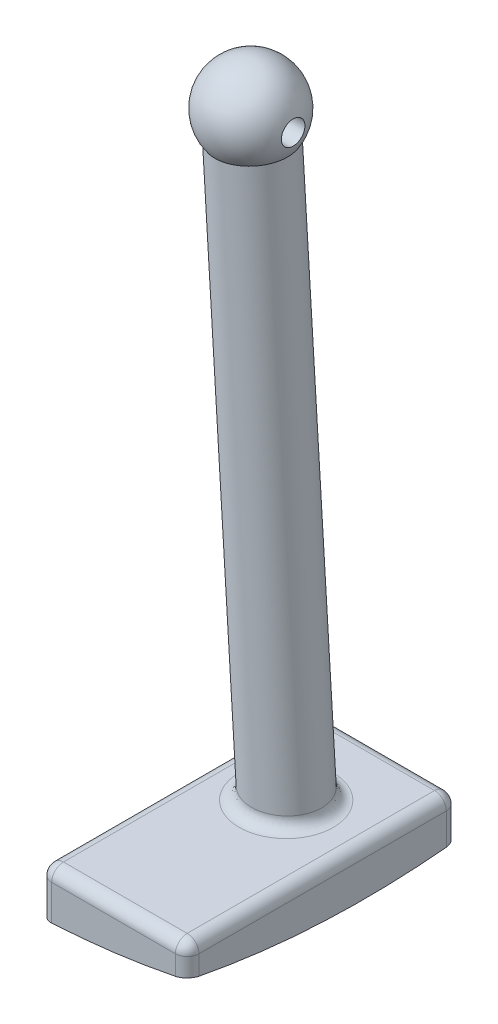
from build123d import *

# Parameters (mm, degrees)
SKETCH3_W          = 107.235310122
SKETCH3_H          = 199.649479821
CUT_EXTRUDE1_DEPTH = 208.460447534
SKETCH4_W          = 33.156143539
SKETCH4_H          = 23.267469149
CUT_EXTRUDE2_DEPTH = 108.581402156
SKETCH5_W          = 39.984782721
SKETCH5_H          = 17.306846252
CUT_EXTRUDE3_DEPTH = 102.48285434
FILLET1_R          = 1.27
SKETCH10_W         = 13.730364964
SKETCH10_H         = 1.27


with BuildPart() as part:
    # Sketch2 → Revolve1 (revolve)
    with BuildSketch(Plane.XY):
        with BuildLine():
            Line((3.81, -95.173769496), (3.81, -88.113686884))
            Line((3.81, -88.113686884), (19.685, -88.113686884))
            Line((19.685, -88.113686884), (19.685, -93.193686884))
            ThreePointArc((19.685, -93.193686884), (11.789144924, -94.517609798), (3.81, -95.173769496))
        make_face()
    revolve(axis=Axis((104.775, 0, 0), (-1, 0, 0)))

    # Sketch3 → Cut-Extrude1 (cut, through all)
    with BuildSketch(Plane(origin=(0, -88.113686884, 0), x_dir=(-1, 0, 0), z_dir=(0, 1, 0))):
        with Locations((-15.257056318, -0.290610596)):
            Rectangle(SKETCH3_W, SKETCH3_H)
    extrude(amount=CUT_EXTRUDE1_DEPTH, mode=Mode.SUBTRACT)

    # Sketch4 → Cut-Extrude2 (cut, through all)
    with BuildSketch(Plane.XY.offset(-10.16)):
        with Locations((11.342891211, -88.561804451)):
            Rectangle(SKETCH4_W, SKETCH4_H)
    extrude(amount=-CUT_EXTRUDE2_DEPTH, mode=Mode.SUBTRACT)

    # Sketch5 → Cut-Extrude3 (cut, through all)
    with BuildSketch(Plane.XY.offset(19.05)):
        with Locations((12.234149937, -91.244955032)):
            Rectangle(SKETCH5_W, SKETCH5_H)
    extrude(amount=CUT_EXTRUDE3_DEPTH, mode=Mode.SUBTRACT)

    # Sketch9 → Revolve3 (revolve)
    with BuildSketch(Plane.XY):
        with BuildLine():
            Line((11.405982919, -88.349924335), (7.201302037, -20.667980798))
            ThreePointArc((7.201302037, -20.667980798), (11.589059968, -23.008484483), (11.472905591, -27.980092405))
            Line((11.472905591, -27.980092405), (15.208651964, -88.113686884))
            Line((15.208651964, -88.113686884), (11.405982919, -88.349924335))
        make_face()
    revolve(axis=Axis((11.405982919, -88.349924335, 0), (-0.06200458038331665, 0.9980758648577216, 0)))

    # Fillet1
    fillet1_edges = [part.edges().sort_by_distance(p)[0] for p in [
        (3.81, -88.113686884, 4.445),
        (11.7475, -88.113686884, -10.16),
        (3.81, -91.371800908, -10.16),
        (19.685, -90.375947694, -10.16),
        (19.685, -88.113686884, 4.445),
        (11.7475, -88.113686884, 19.05),
        (3.81, -90.680721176, 19.05),
        (19.685, -89.669782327, 19.05),
        (7.573961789, -88.113686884, -3e-09),
    ]]
    fillet(fillet1_edges, radius=FILLET1_R)

    # Sketch10 → Cut-Revolve1 (revolve, cut)
    with BuildSketch(Plane.XY, mode=Mode.PRIVATE) as cut_revolve1_sk:
        with Locations((8.343469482, -24.765)):
            Rectangle(SKETCH10_W, SKETCH10_H)
    revolve(cut_revolve1_sk.sketch.rotate(Axis((1.478287, -25.4, 0), (1, 0, 0)), 90), axis=Axis((1.478287, -25.4, 0), (1, 0, 0)), mode=Mode.SUBTRACT)


solid = part.part
